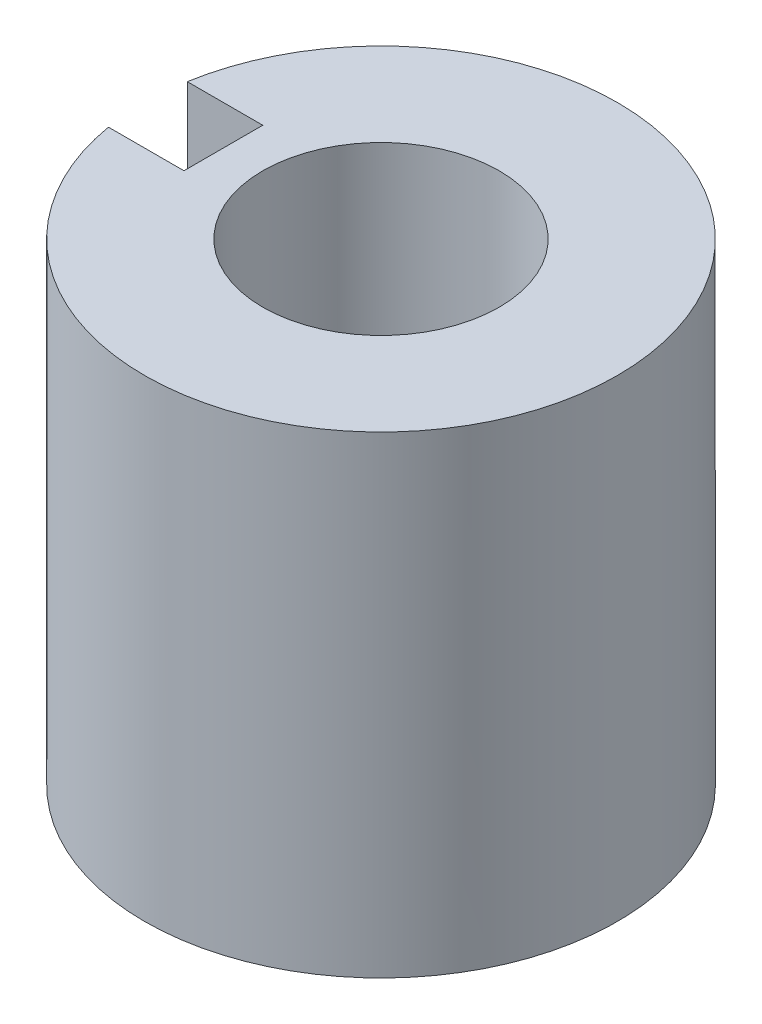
ISO-10303-21;
HEADER;
FILE_DESCRIPTION(('STEP AP214'),'2;1');
FILE_NAME('part.step','',(''),(''),'','','');
FILE_SCHEMA(('AUTOMOTIVE_DESIGN { 1 0 10303 214 1 1 1 1 }'));
ENDSEC;
DATA;
#1=APPLICATION_CONTEXT('core data for automotive mechanical design processes');
#2=APPLICATION_PROTOCOL_DEFINITION('international standard','automotive_design',2000,#1);
#3=PRODUCT_CONTEXT('',#1,'mechanical');
#4=PRODUCT('Part','Part','',(#3));
#5=PRODUCT_RELATED_PRODUCT_CATEGORY('part','',(#4));
#6=PRODUCT_DEFINITION_FORMATION('','',#4);
#7=PRODUCT_DEFINITION_CONTEXT('part definition',#1,'design');
#8=PRODUCT_DEFINITION('design','',#6,#7);
#9=PRODUCT_DEFINITION_SHAPE('','',#8);
#10=(LENGTH_UNIT() NAMED_UNIT(*) SI_UNIT(.MILLI.,.METRE.));
#11=(NAMED_UNIT(*) PLANE_ANGLE_UNIT() SI_UNIT($,.RADIAN.));
#12=(NAMED_UNIT(*) SI_UNIT($,.STERADIAN.) SOLID_ANGLE_UNIT());
#13=UNCERTAINTY_MEASURE_WITH_UNIT(LENGTH_MEASURE(1.E-05),#10,'distance_accuracy_value','');
#14=(GEOMETRIC_REPRESENTATION_CONTEXT(3) GLOBAL_UNCERTAINTY_ASSIGNED_CONTEXT((#13)) GLOBAL_UNIT_ASSIGNED_CONTEXT((#10,
#11,#12)) REPRESENTATION_CONTEXT('',''));
#15=CARTESIAN_POINT('',(0.,0.,0.));
#16=DIRECTION('',(0.,0.,1.));
#17=DIRECTION('',(1.,0.,0.));
#18=AXIS2_PLACEMENT_3D('',#15,#16,#17);
#19=CARTESIAN_POINT('',(3.,6.,0.));
#20=DIRECTION('',(0.,1.,0.));
#21=DIRECTION('',(0.,0.,1.));
#22=AXIS2_PLACEMENT_3D('',#19,#20,#21);
#23=PLANE('',#22);
#24=CARTESIAN_POINT('',(3.,6.,0.));
#25=DIRECTION('',(0.,1.,0.));
#26=DIRECTION('',(0.,0.,1.));
#27=AXIS2_PLACEMENT_3D('',#24,#25,#26);
#28=CIRCLE('',#27,1.5);
#29=CARTESIAN_POINT('',(3.,6.,1.5));
#30=VERTEX_POINT('',#29);
#31=EDGE_CURVE('E143',#30,#30,#28,.T.);
#32=ORIENTED_EDGE('',*,*,#31,.F.);
#33=EDGE_LOOP('',(#32));
#34=FACE_BOUND('',#33,.T.);
#35=CARTESIAN_POINT('',(3.,6.,0.));
#36=DIRECTION('',(0.,1.,0.));
#37=DIRECTION('',(0.,0.,1.));
#38=AXIS2_PLACEMENT_3D('',#35,#36,#37);
#39=CIRCLE('',#38,3.);
#40=CARTESIAN_POINT('',(0.0419601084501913,6.,0.5));
#41=VERTEX_POINT('',#40);
#42=CARTESIAN_POINT('',(0.0419601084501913,6.,-0.5));
#43=VERTEX_POINT('',#42);
#44=EDGE_CURVE('E93',#41,#43,#39,.T.);
#45=ORIENTED_EDGE('',*,*,#44,.T.);
#46=DIRECTION('',(-1.,0.,0.));
#47=VECTOR('',#46,1.);
#48=CARTESIAN_POINT('',(1.,6.,-0.5));
#49=LINE('',#48,#47);
#50=CARTESIAN_POINT('',(1.,6.,-0.5));
#51=VERTEX_POINT('',#50);
#52=EDGE_CURVE('E49',#51,#43,#49,.T.);
#53=ORIENTED_EDGE('',*,*,#52,.F.);
#54=DIRECTION('',(0.,0.,1.));
#55=VECTOR('',#54,1.);
#56=CARTESIAN_POINT('',(1.,6.,0.5));
#57=LINE('',#56,#55);
#58=CARTESIAN_POINT('',(1.,6.,0.5));
#59=VERTEX_POINT('',#58);
#60=EDGE_CURVE('E78',#51,#59,#57,.T.);
#61=ORIENTED_EDGE('',*,*,#60,.T.);
#62=DIRECTION('',(-1.,0.,0.));
#63=VECTOR('',#62,1.);
#64=CARTESIAN_POINT('',(1.,6.,0.5));
#65=LINE('',#64,#63);
#66=EDGE_CURVE('E95',#59,#41,#65,.T.);
#67=ORIENTED_EDGE('',*,*,#66,.T.);
#68=EDGE_LOOP('',(#45,#53,#61,#67));
#69=FACE_BOUND('',#68,.T.);
#70=ADVANCED_FACE('F35',(#34,#69),#23,.T.);
#71=CARTESIAN_POINT('',(3.,6.,0.));
#72=DIRECTION('',(0.,-1.,0.));
#73=DIRECTION('',(0.,0.,-1.));
#74=AXIS2_PLACEMENT_3D('',#71,#72,#73);
#75=CYLINDRICAL_SURFACE('',#74,3.);
#76=CARTESIAN_POINT('',(3.,0.,0.));
#77=DIRECTION('',(0.,1.,0.));
#78=DIRECTION('',(0.,0.,1.));
#79=AXIS2_PLACEMENT_3D('',#76,#77,#78);
#80=CIRCLE('',#79,3.);
#81=CARTESIAN_POINT('',(3.,0.,3.));
#82=VERTEX_POINT('',#81);
#83=EDGE_CURVE('E94',#82,#82,#80,.T.);
#84=ORIENTED_EDGE('',*,*,#83,.T.);
#85=EDGE_LOOP('',(#84));
#86=FACE_BOUND('',#85,.T.);
#87=DIRECTION('',(0.,-1.,0.));
#88=VECTOR('',#87,1.);
#89=CARTESIAN_POINT('',(0.0419601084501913,6.,-0.5));
#90=LINE('',#89,#88);
#91=CARTESIAN_POINT('',(0.0419601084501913,1.5,-0.5));
#92=VERTEX_POINT('',#91);
#93=EDGE_CURVE('E11',#43,#92,#90,.T.);
#94=ORIENTED_EDGE('',*,*,#93,.F.);
#95=ORIENTED_EDGE('',*,*,#44,.F.);
#96=DIRECTION('',(0.,-1.,0.));
#97=VECTOR('',#96,1.);
#98=CARTESIAN_POINT('',(0.0419601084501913,6.,0.5));
#99=LINE('',#98,#97);
#100=CARTESIAN_POINT('',(0.0419601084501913,1.5,0.5));
#101=VERTEX_POINT('',#100);
#102=EDGE_CURVE('E43',#101,#41,#99,.F.);
#103=ORIENTED_EDGE('',*,*,#102,.F.);
#104=CARTESIAN_POINT('',(3.,1.5,0.));
#105=DIRECTION('',(0.,1.,0.));
#106=DIRECTION('',(0.,0.,1.));
#107=AXIS2_PLACEMENT_3D('',#104,#105,#106);
#108=CIRCLE('',#107,3.);
#109=EDGE_CURVE('E103',#92,#101,#108,.T.);
#110=ORIENTED_EDGE('',*,*,#109,.F.);
#111=EDGE_LOOP('',(#94,#95,#103,#110));
#112=FACE_BOUND('',#111,.T.);
#113=ADVANCED_FACE('F37',(#86,#112),#75,.T.);
#114=CARTESIAN_POINT('',(3.,0.,0.));
#115=DIRECTION('',(0.,1.,0.));
#116=DIRECTION('',(0.,0.,1.));
#117=AXIS2_PLACEMENT_3D('',#114,#115,#116);
#118=PLANE('',#117);
#119=CARTESIAN_POINT('',(3.,0.,0.));
#120=DIRECTION('',(0.,1.,0.));
#121=DIRECTION('',(0.,0.,1.));
#122=AXIS2_PLACEMENT_3D('',#119,#120,#121);
#123=CIRCLE('',#122,1.5);
#124=CARTESIAN_POINT('',(3.,0.,1.5));
#125=VERTEX_POINT('',#124);
#126=EDGE_CURVE('E89',#125,#125,#123,.F.);
#127=ORIENTED_EDGE('',*,*,#126,.F.);
#128=EDGE_LOOP('',(#127));
#129=FACE_BOUND('',#128,.T.);
#130=ORIENTED_EDGE('',*,*,#83,.F.);
#131=EDGE_LOOP('',(#130));
#132=FACE_BOUND('',#131,.T.);
#133=ADVANCED_FACE('F111',(#129,#132),#118,.F.);
#134=CARTESIAN_POINT('',(1.,1.5,-0.5));
#135=DIRECTION('',(0.,0.,1.));
#136=DIRECTION('',(0.,-1.,0.));
#137=AXIS2_PLACEMENT_3D('',#134,#135,#136);
#138=PLANE('',#137);
#139=ORIENTED_EDGE('',*,*,#93,.T.);
#140=DIRECTION('',(-1.,0.,0.));
#141=VECTOR('',#140,1.);
#142=CARTESIAN_POINT('',(1.,1.5,-0.5));
#143=LINE('',#142,#141);
#144=CARTESIAN_POINT('',(1.,1.5,-0.5));
#145=VERTEX_POINT('',#144);
#146=EDGE_CURVE('E88',#145,#92,#143,.T.);
#147=ORIENTED_EDGE('',*,*,#146,.F.);
#148=DIRECTION('',(0.,1.,0.));
#149=VECTOR('',#148,1.);
#150=CARTESIAN_POINT('',(1.,1.5,-0.5));
#151=LINE('',#150,#149);
#152=EDGE_CURVE('E81',#145,#51,#151,.T.);
#153=ORIENTED_EDGE('',*,*,#152,.T.);
#154=ORIENTED_EDGE('',*,*,#52,.T.);
#155=EDGE_LOOP('',(#139,#147,#153,#154));
#156=FACE_BOUND('',#155,.T.);
#157=ADVANCED_FACE('F86',(#156),#138,.T.);
#158=CARTESIAN_POINT('',(1.,1.5,0.5));
#159=DIRECTION('',(0.,0.,-1.));
#160=DIRECTION('',(-1.,0.,0.));
#161=AXIS2_PLACEMENT_3D('',#158,#159,#160);
#162=PLANE('',#161);
#163=ORIENTED_EDGE('',*,*,#102,.T.);
#164=ORIENTED_EDGE('',*,*,#66,.F.);
#165=DIRECTION('',(0.,-1.,0.));
#166=VECTOR('',#165,1.);
#167=CARTESIAN_POINT('',(1.,1.5,0.5));
#168=LINE('',#167,#166);
#169=CARTESIAN_POINT('',(1.,1.5,0.5));
#170=VERTEX_POINT('',#169);
#171=EDGE_CURVE('E82',#59,#170,#168,.T.);
#172=ORIENTED_EDGE('',*,*,#171,.T.);
#173=DIRECTION('',(-1.,0.,0.));
#174=VECTOR('',#173,1.);
#175=CARTESIAN_POINT('',(1.,1.5,0.5));
#176=LINE('',#175,#174);
#177=EDGE_CURVE('E99',#170,#101,#176,.T.);
#178=ORIENTED_EDGE('',*,*,#177,.T.);
#179=EDGE_LOOP('',(#163,#164,#172,#178));
#180=FACE_BOUND('',#179,.T.);
#181=ADVANCED_FACE('F109',(#180),#162,.T.);
#182=CARTESIAN_POINT('',(1.,1.5,0.5));
#183=DIRECTION('',(0.,1.,0.));
#184=DIRECTION('',(0.,0.,1.));
#185=AXIS2_PLACEMENT_3D('',#182,#183,#184);
#186=PLANE('',#185);
#187=ORIENTED_EDGE('',*,*,#146,.T.);
#188=ORIENTED_EDGE('',*,*,#109,.T.);
#189=ORIENTED_EDGE('',*,*,#177,.F.);
#190=DIRECTION('',(0.,0.,-1.));
#191=VECTOR('',#190,1.);
#192=CARTESIAN_POINT('',(1.,1.5,0.5));
#193=LINE('',#192,#191);
#194=EDGE_CURVE('E148',#170,#145,#193,.T.);
#195=ORIENTED_EDGE('',*,*,#194,.T.);
#196=EDGE_LOOP('',(#187,#188,#189,#195));
#197=FACE_BOUND('',#196,.T.);
#198=ADVANCED_FACE('F107',(#197),#186,.T.);
#199=CARTESIAN_POINT('',(1.,0.,0.));
#200=DIRECTION('',(-1.,0.,0.));
#201=DIRECTION('',(0.,0.,1.));
#202=AXIS2_PLACEMENT_3D('',#199,#200,#201);
#203=PLANE('',#202);
#204=ORIENTED_EDGE('',*,*,#152,.F.);
#205=ORIENTED_EDGE('',*,*,#194,.F.);
#206=ORIENTED_EDGE('',*,*,#171,.F.);
#207=ORIENTED_EDGE('',*,*,#60,.F.);
#208=EDGE_LOOP('',(#204,#205,#206,#207));
#209=FACE_BOUND('',#208,.T.);
#210=ADVANCED_FACE('F79',(#209),#203,.T.);
#211=CARTESIAN_POINT('',(3.,-4.24264068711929,0.));
#212=DIRECTION('',(0.,1.,0.));
#213=DIRECTION('',(0.,0.,1.));
#214=AXIS2_PLACEMENT_3D('',#211,#212,#213);
#215=CYLINDRICAL_SURFACE('',#214,1.5);
#216=ORIENTED_EDGE('',*,*,#126,.T.);
#217=EDGE_LOOP('',(#216));
#218=FACE_BOUND('',#217,.T.);
#219=ORIENTED_EDGE('',*,*,#31,.T.);
#220=EDGE_LOOP('',(#219));
#221=FACE_BOUND('',#220,.T.);
#222=ADVANCED_FACE('F134',(#218,#221),#215,.F.);
#223=CLOSED_SHELL('',(#70,#113,#133,#157,#181,#198,#210,#222));
#224=MANIFOLD_SOLID_BREP('B2',#223);
#225=ADVANCED_BREP_SHAPE_REPRESENTATION('',(#18,#224),#14);
#226=SHAPE_DEFINITION_REPRESENTATION(#9,#225);
ENDSEC;
END-ISO-10303-21;
